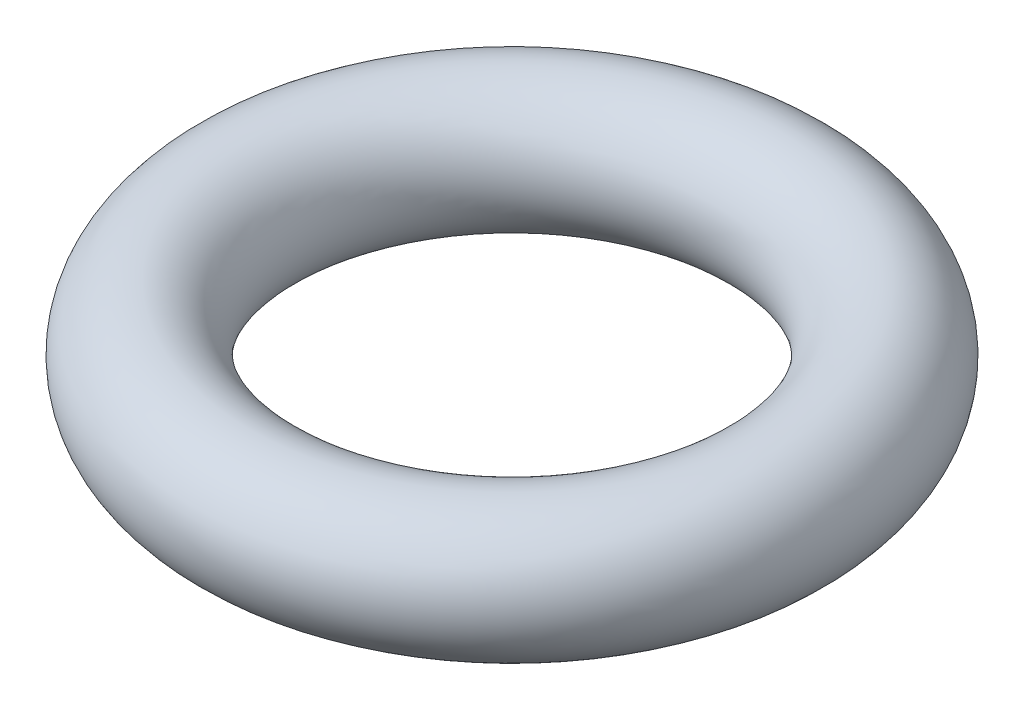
from build123d import *

# Parameters (mm, degrees)
ESQUISSE1_R = 0.85


with BuildPart() as part:
    # Esquisse1 → R_volution1 (revolve)
    with BuildSketch(Plane.XY, mode=Mode.PRIVATE) as r_volution1_sk:
        with Locations((3.4, 0)):
            Circle(ESQUISSE1_R)
    revolve(r_volution1_sk.sketch.rotate(Axis((0, 0, 0), (0, 1, 0)), 90), axis=Axis((0, 0, 0), (0, 1, 0)))


solid = part.part
